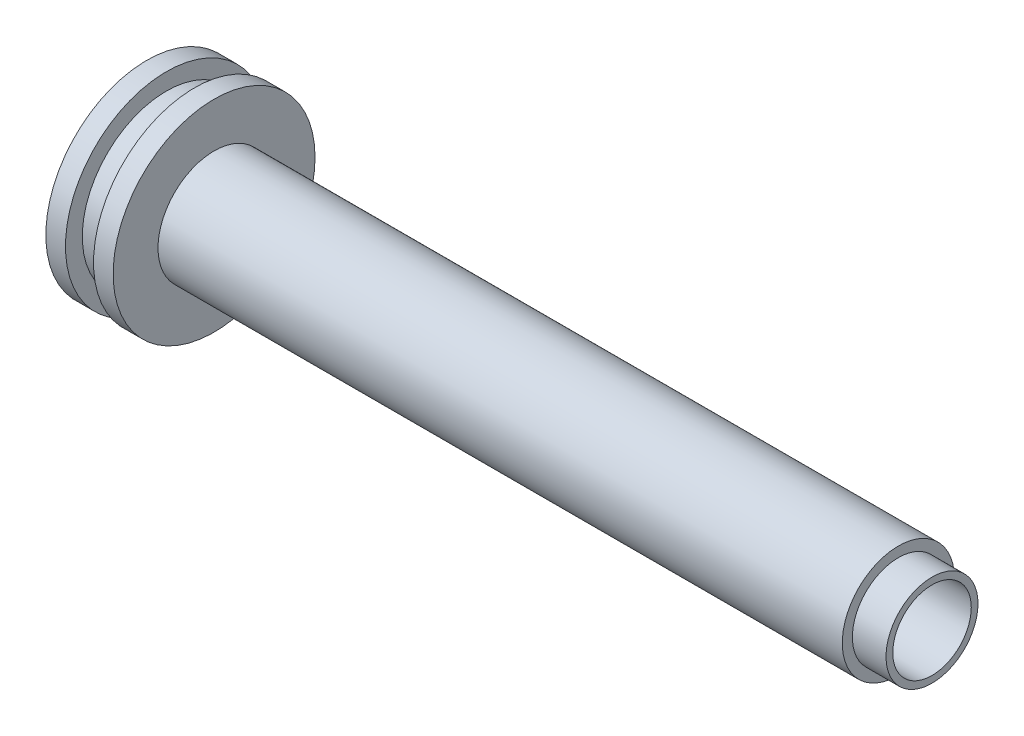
ISO-10303-21;
HEADER;
FILE_DESCRIPTION(('STEP AP214'),'2;1');
FILE_NAME('part.step','',(''),(''),'','','');
FILE_SCHEMA(('AUTOMOTIVE_DESIGN { 1 0 10303 214 1 1 1 1 }'));
ENDSEC;
DATA;
#1=APPLICATION_CONTEXT('core data for automotive mechanical design processes');
#2=APPLICATION_PROTOCOL_DEFINITION('international standard','automotive_design',2000,#1);
#3=PRODUCT_CONTEXT('',#1,'mechanical');
#4=PRODUCT('Part','Part','',(#3));
#5=PRODUCT_RELATED_PRODUCT_CATEGORY('part','',(#4));
#6=PRODUCT_DEFINITION_FORMATION('','',#4);
#7=PRODUCT_DEFINITION_CONTEXT('part definition',#1,'design');
#8=PRODUCT_DEFINITION('design','',#6,#7);
#9=PRODUCT_DEFINITION_SHAPE('','',#8);
#10=(LENGTH_UNIT() NAMED_UNIT(*) SI_UNIT(.MILLI.,.METRE.));
#11=(NAMED_UNIT(*) PLANE_ANGLE_UNIT() SI_UNIT($,.RADIAN.));
#12=(NAMED_UNIT(*) SI_UNIT($,.STERADIAN.) SOLID_ANGLE_UNIT());
#13=UNCERTAINTY_MEASURE_WITH_UNIT(LENGTH_MEASURE(1.E-05),#10,'distance_accuracy_value','');
#14=(GEOMETRIC_REPRESENTATION_CONTEXT(3) GLOBAL_UNCERTAINTY_ASSIGNED_CONTEXT((#13)) GLOBAL_UNIT_ASSIGNED_CONTEXT((#10,
#11,#12)) REPRESENTATION_CONTEXT('',''));
#15=CARTESIAN_POINT('',(0.,0.,0.));
#16=DIRECTION('',(0.,0.,1.));
#17=DIRECTION('',(1.,0.,0.));
#18=AXIS2_PLACEMENT_3D('',#15,#16,#17);
#19=CARTESIAN_POINT('',(4.24999999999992,0.,0.));
#20=DIRECTION('',(1.,0.,0.));
#21=DIRECTION('',(0.,0.,-1.));
#22=AXIS2_PLACEMENT_3D('',#19,#20,#21);
#23=PLANE('',#22);
#24=CARTESIAN_POINT('',(4.24999999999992,0.,0.));
#25=DIRECTION('',(1.,0.,0.));
#26=DIRECTION('',(0.,0.,-1.));
#27=AXIS2_PLACEMENT_3D('',#24,#25,#26);
#28=CIRCLE('',#27,7.5);
#29=CARTESIAN_POINT('',(4.24999999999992,0.,-7.5));
#30=VERTEX_POINT('',#29);
#31=EDGE_CURVE('E53',#30,#30,#28,.F.);
#32=ORIENTED_EDGE('',*,*,#31,.F.);
#33=EDGE_LOOP('',(#32));
#34=FACE_BOUND('',#33,.T.);
#35=CARTESIAN_POINT('',(4.24999999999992,0.,0.));
#36=DIRECTION('',(1.,0.,0.));
#37=DIRECTION('',(0.,0.,-1.));
#38=AXIS2_PLACEMENT_3D('',#35,#36,#37);
#39=CIRCLE('',#38,9.);
#40=CARTESIAN_POINT('',(4.24999999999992,0.,-9.00000000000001));
#41=VERTEX_POINT('',#40);
#42=EDGE_CURVE('E16',#41,#41,#39,.T.);
#43=ORIENTED_EDGE('',*,*,#42,.F.);
#44=EDGE_LOOP('',(#43));
#45=FACE_BOUND('',#44,.T.);
#46=ADVANCED_FACE('F12',(#34,#45),#23,.F.);
#47=CARTESIAN_POINT('',(4.24999999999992,0.,0.));
#48=DIRECTION('',(1.,0.,0.));
#49=DIRECTION('',(0.,0.,-1.));
#50=AXIS2_PLACEMENT_3D('',#47,#48,#49);
#51=CYLINDRICAL_SURFACE('',#50,9.);
#52=CARTESIAN_POINT('',(6.00000000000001,0.,0.));
#53=DIRECTION('',(1.,0.,0.));
#54=DIRECTION('',(0.,0.,-1.));
#55=AXIS2_PLACEMENT_3D('',#52,#53,#54);
#56=CIRCLE('',#55,9.);
#57=CARTESIAN_POINT('',(6.00000000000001,0.,-9.));
#58=VERTEX_POINT('',#57);
#59=EDGE_CURVE('E51',#58,#58,#56,.T.);
#60=ORIENTED_EDGE('',*,*,#59,.F.);
#61=EDGE_LOOP('',(#60));
#62=FACE_BOUND('',#61,.T.);
#63=ORIENTED_EDGE('',*,*,#42,.T.);
#64=EDGE_LOOP('',(#63));
#65=FACE_BOUND('',#64,.T.);
#66=ADVANCED_FACE('F60',(#62,#65),#51,.T.);
#67=CARTESIAN_POINT('',(1.75,0.,0.));
#68=DIRECTION('',(1.,0.,0.));
#69=DIRECTION('',(0.,0.,-1.));
#70=AXIS2_PLACEMENT_3D('',#67,#68,#69);
#71=CYLINDRICAL_SURFACE('',#70,7.5);
#72=ORIENTED_EDGE('',*,*,#31,.T.);
#73=EDGE_LOOP('',(#72));
#74=FACE_BOUND('',#73,.T.);
#75=CARTESIAN_POINT('',(1.75,0.,0.));
#76=DIRECTION('',(1.,0.,0.));
#77=DIRECTION('',(0.,0.,-1.));
#78=AXIS2_PLACEMENT_3D('',#75,#76,#77);
#79=CIRCLE('',#78,7.5);
#80=CARTESIAN_POINT('',(1.75,0.,-7.5));
#81=VERTEX_POINT('',#80);
#82=EDGE_CURVE('E48',#81,#81,#79,.F.);
#83=ORIENTED_EDGE('',*,*,#82,.F.);
#84=EDGE_LOOP('',(#83));
#85=FACE_BOUND('',#84,.T.);
#86=ADVANCED_FACE('F69',(#74,#85),#71,.T.);
#87=CARTESIAN_POINT('',(6.00000000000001,0.,0.));
#88=DIRECTION('',(1.,0.,0.));
#89=DIRECTION('',(0.,0.,-1.));
#90=AXIS2_PLACEMENT_3D('',#87,#88,#89);
#91=PLANE('',#90);
#92=CARTESIAN_POINT('',(6.00000000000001,0.,0.));
#93=DIRECTION('',(1.,0.,0.));
#94=DIRECTION('',(0.,0.,-1.));
#95=AXIS2_PLACEMENT_3D('',#92,#93,#94);
#96=CIRCLE('',#95,5.);
#97=CARTESIAN_POINT('',(6.00000000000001,0.,-5.));
#98=VERTEX_POINT('',#97);
#99=EDGE_CURVE('E45',#98,#98,#96,.T.);
#100=ORIENTED_EDGE('',*,*,#99,.F.);
#101=EDGE_LOOP('',(#100));
#102=FACE_BOUND('',#101,.T.);
#103=ORIENTED_EDGE('',*,*,#59,.T.);
#104=EDGE_LOOP('',(#103));
#105=FACE_BOUND('',#104,.T.);
#106=ADVANCED_FACE('F104',(#102,#105),#91,.T.);
#107=CARTESIAN_POINT('',(1.75,0.,0.));
#108=DIRECTION('',(1.,0.,0.));
#109=DIRECTION('',(0.,0.,-1.));
#110=AXIS2_PLACEMENT_3D('',#107,#108,#109);
#111=PLANE('',#110);
#112=ORIENTED_EDGE('',*,*,#82,.T.);
#113=EDGE_LOOP('',(#112));
#114=FACE_BOUND('',#113,.T.);
#115=CARTESIAN_POINT('',(1.75,0.,0.));
#116=DIRECTION('',(1.,0.,0.));
#117=DIRECTION('',(0.,0.,-1.));
#118=AXIS2_PLACEMENT_3D('',#115,#116,#117);
#119=CIRCLE('',#118,9.);
#120=CARTESIAN_POINT('',(1.75,0.,-9.00000000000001));
#121=VERTEX_POINT('',#120);
#122=EDGE_CURVE('E42',#121,#121,#119,.F.);
#123=ORIENTED_EDGE('',*,*,#122,.F.);
#124=EDGE_LOOP('',(#123));
#125=FACE_BOUND('',#124,.T.);
#126=ADVANCED_FACE('F102',(#114,#125),#111,.T.);
#127=CARTESIAN_POINT('',(6.00000000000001,0.,0.));
#128=DIRECTION('',(1.,0.,0.));
#129=DIRECTION('',(0.,0.,-1.));
#130=AXIS2_PLACEMENT_3D('',#127,#128,#129);
#131=CYLINDRICAL_SURFACE('',#130,5.);
#132=ORIENTED_EDGE('',*,*,#99,.T.);
#133=EDGE_LOOP('',(#132));
#134=FACE_BOUND('',#133,.T.);
#135=CARTESIAN_POINT('',(67.,0.,0.));
#136=DIRECTION('',(1.,0.,0.));
#137=DIRECTION('',(0.,0.,-1.));
#138=AXIS2_PLACEMENT_3D('',#135,#136,#137);
#139=CIRCLE('',#138,5.);
#140=CARTESIAN_POINT('',(67.,0.,-5.));
#141=VERTEX_POINT('',#140);
#142=EDGE_CURVE('E39',#141,#141,#139,.T.);
#143=ORIENTED_EDGE('',*,*,#142,.F.);
#144=EDGE_LOOP('',(#143));
#145=FACE_BOUND('',#144,.T.);
#146=ADVANCED_FACE('F98',(#134,#145),#131,.T.);
#147=CARTESIAN_POINT('',(0.,0.,0.));
#148=DIRECTION('',(1.,0.,0.));
#149=DIRECTION('',(0.,0.,-1.));
#150=AXIS2_PLACEMENT_3D('',#147,#148,#149);
#151=CYLINDRICAL_SURFACE('',#150,9.);
#152=CARTESIAN_POINT('',(0.,0.,0.));
#153=DIRECTION('',(1.,0.,0.));
#154=DIRECTION('',(0.,0.,-1.));
#155=AXIS2_PLACEMENT_3D('',#152,#153,#154);
#156=CIRCLE('',#155,9.);
#157=CARTESIAN_POINT('',(0.,0.,-9.00000000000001));
#158=VERTEX_POINT('',#157);
#159=EDGE_CURVE('E36',#158,#158,#156,.T.);
#160=ORIENTED_EDGE('',*,*,#159,.T.);
#161=EDGE_LOOP('',(#160));
#162=FACE_BOUND('',#161,.T.);
#163=ORIENTED_EDGE('',*,*,#122,.T.);
#164=EDGE_LOOP('',(#163));
#165=FACE_BOUND('',#164,.T.);
#166=ADVANCED_FACE('F95',(#162,#165),#151,.T.);
#167=CARTESIAN_POINT('',(67.,0.,0.));
#168=DIRECTION('',(1.,0.,0.));
#169=DIRECTION('',(0.,0.,-1.));
#170=AXIS2_PLACEMENT_3D('',#167,#168,#169);
#171=PLANE('',#170);
#172=CARTESIAN_POINT('',(67.,0.,0.));
#173=DIRECTION('',(1.,0.,0.));
#174=DIRECTION('',(0.,0.,-1.));
#175=AXIS2_PLACEMENT_3D('',#172,#173,#174);
#176=CIRCLE('',#175,4.1);
#177=CARTESIAN_POINT('',(67.,0.,-4.1));
#178=VERTEX_POINT('',#177);
#179=EDGE_CURVE('E33',#178,#178,#176,.T.);
#180=ORIENTED_EDGE('',*,*,#179,.F.);
#181=EDGE_LOOP('',(#180));
#182=FACE_BOUND('',#181,.T.);
#183=ORIENTED_EDGE('',*,*,#142,.T.);
#184=EDGE_LOOP('',(#183));
#185=FACE_BOUND('',#184,.T.);
#186=ADVANCED_FACE('F91',(#182,#185),#171,.T.);
#187=CARTESIAN_POINT('',(0.,0.,0.));
#188=DIRECTION('',(1.,0.,0.));
#189=DIRECTION('',(0.,0.,-1.));
#190=AXIS2_PLACEMENT_3D('',#187,#188,#189);
#191=PLANE('',#190);
#192=CARTESIAN_POINT('',(0.,0.,0.));
#193=DIRECTION('',(1.,0.,0.));
#194=DIRECTION('',(0.,0.,-1.));
#195=AXIS2_PLACEMENT_3D('',#192,#193,#194);
#196=CIRCLE('',#195,4.49994440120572);
#197=CARTESIAN_POINT('',(0.,0.,-4.49994440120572));
#198=VERTEX_POINT('',#197);
#199=EDGE_CURVE('E30',#198,#198,#196,.T.);
#200=ORIENTED_EDGE('',*,*,#199,.T.);
#201=EDGE_LOOP('',(#200));
#202=FACE_BOUND('',#201,.T.);
#203=ORIENTED_EDGE('',*,*,#159,.F.);
#204=EDGE_LOOP('',(#203));
#205=FACE_BOUND('',#204,.T.);
#206=ADVANCED_FACE('F88',(#202,#205),#191,.F.);
#207=CARTESIAN_POINT('',(67.,0.,0.));
#208=DIRECTION('',(1.,0.,0.));
#209=DIRECTION('',(0.,0.,-1.));
#210=AXIS2_PLACEMENT_3D('',#207,#208,#209);
#211=CYLINDRICAL_SURFACE('',#210,4.1);
#212=ORIENTED_EDGE('',*,*,#179,.T.);
#213=EDGE_LOOP('',(#212));
#214=FACE_BOUND('',#213,.T.);
#215=CARTESIAN_POINT('',(69.9999999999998,0.,0.));
#216=DIRECTION('',(1.,0.,0.));
#217=DIRECTION('',(0.,0.,-1.));
#218=AXIS2_PLACEMENT_3D('',#215,#216,#217);
#219=CIRCLE('',#218,4.1);
#220=CARTESIAN_POINT('',(69.9999999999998,0.,-4.1));
#221=VERTEX_POINT('',#220);
#222=EDGE_CURVE('E25',#221,#221,#219,.T.);
#223=ORIENTED_EDGE('',*,*,#222,.F.);
#224=EDGE_LOOP('',(#223));
#225=FACE_BOUND('',#224,.T.);
#226=ADVANCED_FACE('F84',(#214,#225),#211,.T.);
#227=CARTESIAN_POINT('',(-2.08834195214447E-05,0.,0.));
#228=DIRECTION('',(-1.,0.,0.));
#229=DIRECTION('',(0.,0.,1.));
#230=AXIS2_PLACEMENT_3D('',#227,#228,#229);
#231=CONICAL_SURFACE('',#230,4.49996528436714,0.785391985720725);
#232=CARTESIAN_POINT('',(0.999956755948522,0.,0.));
#233=DIRECTION('',(-1.,0.,0.));
#234=DIRECTION('',(0.,0.,1.));
#235=AXIS2_PLACEMENT_3D('',#232,#233,#234);
#236=CIRCLE('',#235,3.5);
#237=CARTESIAN_POINT('',(0.999956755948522,0.,3.5));
#238=VERTEX_POINT('',#237);
#239=EDGE_CURVE('E20',#238,#238,#236,.F.);
#240=ORIENTED_EDGE('',*,*,#239,.T.);
#241=EDGE_LOOP('',(#240));
#242=FACE_BOUND('',#241,.T.);
#243=ORIENTED_EDGE('',*,*,#199,.F.);
#244=EDGE_LOOP('',(#243));
#245=FACE_BOUND('',#244,.T.);
#246=ADVANCED_FACE('F78',(#242,#245),#231,.F.);
#247=CARTESIAN_POINT('',(69.9999999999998,0.,0.));
#248=DIRECTION('',(1.,0.,0.));
#249=DIRECTION('',(0.,0.,-1.));
#250=AXIS2_PLACEMENT_3D('',#247,#248,#249);
#251=PLANE('',#250);
#252=CARTESIAN_POINT('',(69.9999999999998,0.,0.));
#253=DIRECTION('',(1.,0.,0.));
#254=DIRECTION('',(0.,0.,-1.));
#255=AXIS2_PLACEMENT_3D('',#252,#253,#254);
#256=CIRCLE('',#255,3.5);
#257=CARTESIAN_POINT('',(69.9999999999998,0.,-3.5));
#258=VERTEX_POINT('',#257);
#259=EDGE_CURVE('E8',#258,#258,#256,.F.);
#260=ORIENTED_EDGE('',*,*,#259,.T.);
#261=EDGE_LOOP('',(#260));
#262=FACE_BOUND('',#261,.T.);
#263=ORIENTED_EDGE('',*,*,#222,.T.);
#264=EDGE_LOOP('',(#263));
#265=FACE_BOUND('',#264,.T.);
#266=ADVANCED_FACE('F73',(#262,#265),#251,.T.);
#267=CARTESIAN_POINT('',(0.999989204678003,0.,0.));
#268=DIRECTION('',(1.,0.,0.));
#269=DIRECTION('',(0.,0.,-1.));
#270=AXIS2_PLACEMENT_3D('',#267,#268,#269);
#271=CYLINDRICAL_SURFACE('',#270,3.5);
#272=ORIENTED_EDGE('',*,*,#259,.F.);
#273=EDGE_LOOP('',(#272));
#274=FACE_BOUND('',#273,.T.);
#275=ORIENTED_EDGE('',*,*,#239,.F.);
#276=EDGE_LOOP('',(#275));
#277=FACE_BOUND('',#276,.T.);
#278=ADVANCED_FACE('F14',(#274,#277),#271,.F.);
#279=CLOSED_SHELL('',(#46,#66,#86,#106,#126,#146,#166,#186,#206,#226,#246,#266,#278));
#280=MANIFOLD_SOLID_BREP('B1',#279);
#281=ADVANCED_BREP_SHAPE_REPRESENTATION('',(#18,#280),#14);
#282=SHAPE_DEFINITION_REPRESENTATION(#9,#281);
ENDSEC;
END-ISO-10303-21;
